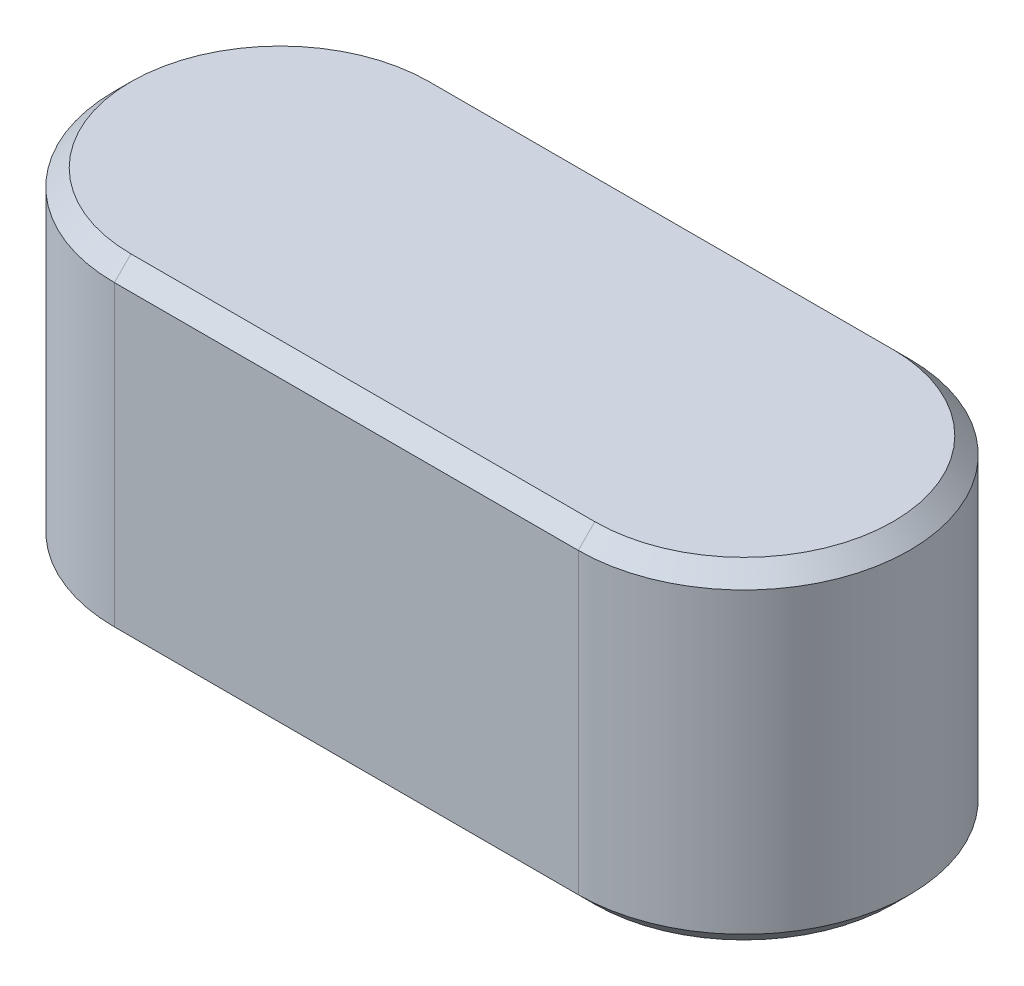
from build123d import *

# Parameters (mm, degrees)
BASE_EXTRUSION_DEPTH = 5
CHANFREIN1_SIZE      = 0.25


with BuildPart() as part:
    # Esquisse1 → Base-Extrusion (new body)
    with BuildSketch(Plane(origin=(0, 0, 0), x_dir=(1, 0, 0), z_dir=(0, 1, 0))):
        with BuildLine():
            Line((7, 2.5), (0, 2.5))
            ThreePointArc((0, 2.5), (-2.5, 0), (0, -2.5))
            Line((0, -2.5), (7, -2.5))
            ThreePointArc((7, -2.5), (9.5, 0), (7, 2.5))
        make_face()
    extrude(amount=BASE_EXTRUSION_DEPTH)

    # Chanfrein1
    chanfrein1_edges = [part.edges().sort_by_distance(p)[0] for p in [
        (9.5, 5, 0),
        (3.5, 5, -2.5),
        (-2.5, 5, 0),
        (3.5, 0, -2.5),
        (9.5, 0, 0),
        (3.5, 0, 2.5),
        (-2.5, 0, 0),
        (3.5, 5, 2.5),
    ]]
    chamfer(chanfrein1_edges, length=CHANFREIN1_SIZE)


solid = part.part
